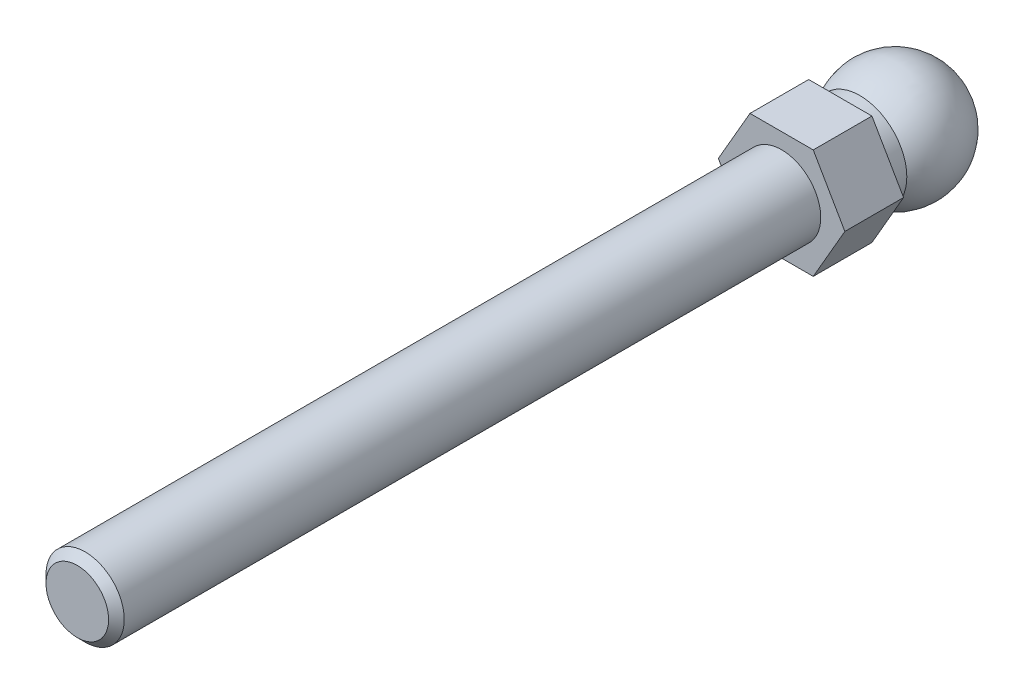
ISO-10303-21;
HEADER;
FILE_DESCRIPTION(('STEP AP214'),'2;1');
FILE_NAME('part.step','',(''),(''),'','','');
FILE_SCHEMA(('AUTOMOTIVE_DESIGN { 1 0 10303 214 1 1 1 1 }'));
ENDSEC;
DATA;
#1=APPLICATION_CONTEXT('core data for automotive mechanical design processes');
#2=APPLICATION_PROTOCOL_DEFINITION('international standard','automotive_design',2000,#1);
#3=PRODUCT_CONTEXT('',#1,'mechanical');
#4=PRODUCT('Part','Part','',(#3));
#5=PRODUCT_RELATED_PRODUCT_CATEGORY('part','',(#4));
#6=PRODUCT_DEFINITION_FORMATION('','',#4);
#7=PRODUCT_DEFINITION_CONTEXT('part definition',#1,'design');
#8=PRODUCT_DEFINITION('design','',#6,#7);
#9=PRODUCT_DEFINITION_SHAPE('','',#8);
#10=(LENGTH_UNIT() NAMED_UNIT(*) SI_UNIT(.MILLI.,.METRE.));
#11=(NAMED_UNIT(*) PLANE_ANGLE_UNIT() SI_UNIT($,.RADIAN.));
#12=(NAMED_UNIT(*) SI_UNIT($,.STERADIAN.) SOLID_ANGLE_UNIT());
#13=UNCERTAINTY_MEASURE_WITH_UNIT(LENGTH_MEASURE(1.E-05),#10,'distance_accuracy_value','');
#14=(GEOMETRIC_REPRESENTATION_CONTEXT(3) GLOBAL_UNCERTAINTY_ASSIGNED_CONTEXT((#13)) GLOBAL_UNIT_ASSIGNED_CONTEXT((#10,
#11,#12)) REPRESENTATION_CONTEXT('',''));
#15=CARTESIAN_POINT('',(0.,0.,0.));
#16=DIRECTION('',(0.,0.,1.));
#17=DIRECTION('',(1.,0.,0.));
#18=AXIS2_PLACEMENT_3D('',#15,#16,#17);
#19=CARTESIAN_POINT('',(0.,0.,0.));
#20=DIRECTION('',(1.,0.,0.));
#21=DIRECTION('',(0.,1.,0.));
#22=AXIS2_PLACEMENT_3D('',#19,#20,#21);
#23=SPHERICAL_SURFACE('',#22,7.5);
#24=CARTESIAN_POINT('',(-7.5,0.,0.));
#25=VERTEX_POINT('',#24);
#26=VERTEX_LOOP('',#25);
#27=FACE_BOUND('',#26,.T.);
#28=CARTESIAN_POINT('',(7.5,0.,0.));
#29=VERTEX_POINT('',#28);
#30=VERTEX_LOOP('',#29);
#31=FACE_BOUND('',#30,.T.);
#32=CARTESIAN_POINT('',(0.,0.,4.5));
#33=DIRECTION('',(0.,0.,1.));
#34=DIRECTION('',(1.,0.,0.));
#35=AXIS2_PLACEMENT_3D('',#32,#33,#34);
#36=CIRCLE('',#35,6.);
#37=CARTESIAN_POINT('',(6.,0.,4.5));
#38=VERTEX_POINT('',#37);
#39=EDGE_CURVE('E20',#38,#38,#36,.T.);
#40=ORIENTED_EDGE('',*,*,#39,.F.);
#41=EDGE_LOOP('',(#40));
#42=FACE_BOUND('',#41,.T.);
#43=ADVANCED_FACE('F16',(#27,#31,#42),#23,.T.);
#44=CARTESIAN_POINT('',(0.,0.,0.));
#45=DIRECTION('',(0.,0.,1.));
#46=DIRECTION('',(1.,0.,0.));
#47=AXIS2_PLACEMENT_3D('',#44,#45,#46);
#48=CYLINDRICAL_SURFACE('',#47,6.);
#49=ORIENTED_EDGE('',*,*,#39,.T.);
#50=EDGE_LOOP('',(#49));
#51=FACE_BOUND('',#50,.T.);
#52=CARTESIAN_POINT('',(0.,0.,7.));
#53=DIRECTION('',(0.,0.,1.));
#54=DIRECTION('',(1.,0.,0.));
#55=AXIS2_PLACEMENT_3D('',#52,#53,#54);
#56=CIRCLE('',#55,6.);
#57=CARTESIAN_POINT('',(6.,0.,7.));
#58=VERTEX_POINT('',#57);
#59=EDGE_CURVE('E79',#58,#58,#56,.F.);
#60=ORIENTED_EDGE('',*,*,#59,.T.);
#61=EDGE_LOOP('',(#60));
#62=FACE_BOUND('',#61,.T.);
#63=ADVANCED_FACE('F74',(#51,#62),#48,.T.);
#64=CARTESIAN_POINT('',(0.,0.,7.));
#65=DIRECTION('',(0.,0.,1.));
#66=DIRECTION('',(1.,0.,0.));
#67=AXIS2_PLACEMENT_3D('',#64,#65,#66);
#68=PLANE('',#67);
#69=ORIENTED_EDGE('',*,*,#59,.F.);
#70=EDGE_LOOP('',(#69));
#71=FACE_BOUND('',#70,.T.);
#72=DIRECTION('',(-0.500000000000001,0.866025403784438,0.));
#73=VECTOR('',#72,1.);
#74=CARTESIAN_POINT('',(4.04145188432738,7.,7.));
#75=LINE('',#74,#73);
#76=CARTESIAN_POINT('',(8.08290376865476,0.,7.));
#77=VERTEX_POINT('',#76);
#78=CARTESIAN_POINT('',(4.04145188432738,7.,7.));
#79=VERTEX_POINT('',#78);
#80=EDGE_CURVE('E81',#77,#79,#75,.T.);
#81=ORIENTED_EDGE('',*,*,#80,.F.);
#82=DIRECTION('',(0.5,0.866025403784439,0.));
#83=VECTOR('',#82,1.);
#84=CARTESIAN_POINT('',(8.08290376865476,0.,7.));
#85=LINE('',#84,#83);
#86=CARTESIAN_POINT('',(4.04145188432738,-7.,7.));
#87=VERTEX_POINT('',#86);
#88=EDGE_CURVE('E114',#87,#77,#85,.T.);
#89=ORIENTED_EDGE('',*,*,#88,.F.);
#90=DIRECTION('',(1.,0.,0.));
#91=VECTOR('',#90,1.);
#92=CARTESIAN_POINT('',(4.04145188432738,-7.,7.));
#93=LINE('',#92,#91);
#94=CARTESIAN_POINT('',(-4.04145188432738,-7.,7.));
#95=VERTEX_POINT('',#94);
#96=EDGE_CURVE('E111',#95,#87,#93,.T.);
#97=ORIENTED_EDGE('',*,*,#96,.F.);
#98=DIRECTION('',(0.5,-0.866025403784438,0.));
#99=VECTOR('',#98,1.);
#100=CARTESIAN_POINT('',(-4.04145188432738,-7.,7.));
#101=LINE('',#100,#99);
#102=CARTESIAN_POINT('',(-8.08290376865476,0.,7.));
#103=VERTEX_POINT('',#102);
#104=EDGE_CURVE('E106',#103,#95,#101,.T.);
#105=ORIENTED_EDGE('',*,*,#104,.F.);
#106=DIRECTION('',(-0.5,-0.866025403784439,0.));
#107=VECTOR('',#106,1.);
#108=CARTESIAN_POINT('',(-8.08290376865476,0.,7.));
#109=LINE('',#108,#107);
#110=CARTESIAN_POINT('',(-4.04145188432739,7.,7.));
#111=VERTEX_POINT('',#110);
#112=EDGE_CURVE('E101',#111,#103,#109,.T.);
#113=ORIENTED_EDGE('',*,*,#112,.F.);
#114=DIRECTION('',(1.,0.,0.));
#115=VECTOR('',#114,1.);
#116=CARTESIAN_POINT('',(-4.04145188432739,7.,7.));
#117=LINE('',#116,#115);
#118=EDGE_CURVE('E96',#79,#111,#117,.F.);
#119=ORIENTED_EDGE('',*,*,#118,.F.);
#120=EDGE_LOOP('',(#81,#89,#97,#105,#113,#119));
#121=FACE_BOUND('',#120,.T.);
#122=ADVANCED_FACE('F235',(#71,#121),#68,.F.);
#123=CARTESIAN_POINT('',(4.04145188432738,7.,7.));
#124=DIRECTION('',(0.866025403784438,0.500000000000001,0.));
#125=DIRECTION('',(-0.500000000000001,0.866025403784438,0.));
#126=AXIS2_PLACEMENT_3D('',#123,#124,#125);
#127=PLANE('',#126);
#128=ORIENTED_EDGE('',*,*,#80,.T.);
#129=DIRECTION('',(0.,0.,1.));
#130=VECTOR('',#129,1.);
#131=CARTESIAN_POINT('',(4.04145188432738,7.,7.));
#132=LINE('',#131,#130);
#133=CARTESIAN_POINT('',(4.04145188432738,7.,14.5));
#134=VERTEX_POINT('',#133);
#135=EDGE_CURVE('E84',#134,#79,#132,.F.);
#136=ORIENTED_EDGE('',*,*,#135,.F.);
#137=DIRECTION('',(-0.500000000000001,0.866025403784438,0.));
#138=VECTOR('',#137,1.);
#139=CARTESIAN_POINT('',(8.08290376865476,0.,14.5));
#140=LINE('',#139,#138);
#141=CARTESIAN_POINT('',(8.08290376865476,0.,14.5));
#142=VERTEX_POINT('',#141);
#143=EDGE_CURVE('E120',#142,#134,#140,.T.);
#144=ORIENTED_EDGE('',*,*,#143,.F.);
#145=DIRECTION('',(0.,0.,1.));
#146=VECTOR('',#145,1.);
#147=CARTESIAN_POINT('',(8.08290376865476,0.,7.));
#148=LINE('',#147,#146);
#149=EDGE_CURVE('E117',#77,#142,#148,.T.);
#150=ORIENTED_EDGE('',*,*,#149,.F.);
#151=EDGE_LOOP('',(#128,#136,#144,#150));
#152=FACE_BOUND('',#151,.T.);
#153=ADVANCED_FACE('F145',(#152),#127,.T.);
#154=CARTESIAN_POINT('',(-4.04145188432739,7.,7.));
#155=DIRECTION('',(0.,1.,0.));
#156=DIRECTION('',(0.,0.,1.));
#157=AXIS2_PLACEMENT_3D('',#154,#155,#156);
#158=PLANE('',#157);
#159=ORIENTED_EDGE('',*,*,#118,.T.);
#160=DIRECTION('',(0.,0.,1.));
#161=VECTOR('',#160,1.);
#162=CARTESIAN_POINT('',(-4.04145188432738,7.,7.));
#163=LINE('',#162,#161);
#164=CARTESIAN_POINT('',(-4.04145188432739,7.,14.5));
#165=VERTEX_POINT('',#164);
#166=EDGE_CURVE('E98',#165,#111,#163,.F.);
#167=ORIENTED_EDGE('',*,*,#166,.F.);
#168=DIRECTION('',(1.,0.,0.));
#169=VECTOR('',#168,1.);
#170=CARTESIAN_POINT('',(0.,7.,14.5));
#171=LINE('',#170,#169);
#172=EDGE_CURVE('E123',#134,#165,#171,.F.);
#173=ORIENTED_EDGE('',*,*,#172,.F.);
#174=ORIENTED_EDGE('',*,*,#135,.T.);
#175=EDGE_LOOP('',(#159,#167,#173,#174));
#176=FACE_BOUND('',#175,.T.);
#177=ADVANCED_FACE('F149',(#176),#158,.T.);
#178=CARTESIAN_POINT('',(-8.08290376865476,0.,7.));
#179=DIRECTION('',(-0.866025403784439,0.5,0.));
#180=DIRECTION('',(-0.5,-0.866025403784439,0.));
#181=AXIS2_PLACEMENT_3D('',#178,#179,#180);
#182=PLANE('',#181);
#183=ORIENTED_EDGE('',*,*,#112,.T.);
#184=DIRECTION('',(0.,0.,1.));
#185=VECTOR('',#184,1.);
#186=CARTESIAN_POINT('',(-8.08290376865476,0.,7.));
#187=LINE('',#186,#185);
#188=CARTESIAN_POINT('',(-8.08290376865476,0.,14.5));
#189=VERTEX_POINT('',#188);
#190=EDGE_CURVE('E103',#189,#103,#187,.F.);
#191=ORIENTED_EDGE('',*,*,#190,.F.);
#192=DIRECTION('',(-0.5,-0.866025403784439,0.));
#193=VECTOR('',#192,1.);
#194=CARTESIAN_POINT('',(-4.04145188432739,7.,14.5));
#195=LINE('',#194,#193);
#196=EDGE_CURVE('E126',#165,#189,#195,.T.);
#197=ORIENTED_EDGE('',*,*,#196,.F.);
#198=ORIENTED_EDGE('',*,*,#166,.T.);
#199=EDGE_LOOP('',(#183,#191,#197,#198));
#200=FACE_BOUND('',#199,.T.);
#201=ADVANCED_FACE('F153',(#200),#182,.T.);
#202=CARTESIAN_POINT('',(-4.04145188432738,-7.,7.));
#203=DIRECTION('',(-0.866025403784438,-0.5,0.));
#204=DIRECTION('',(0.5,-0.866025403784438,0.));
#205=AXIS2_PLACEMENT_3D('',#202,#203,#204);
#206=PLANE('',#205);
#207=ORIENTED_EDGE('',*,*,#104,.T.);
#208=DIRECTION('',(0.,0.,-1.));
#209=VECTOR('',#208,1.);
#210=CARTESIAN_POINT('',(-4.04145188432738,-7.,7.));
#211=LINE('',#210,#209);
#212=CARTESIAN_POINT('',(-4.04145188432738,-7.,14.5));
#213=VERTEX_POINT('',#212);
#214=EDGE_CURVE('E108',#213,#95,#211,.T.);
#215=ORIENTED_EDGE('',*,*,#214,.F.);
#216=DIRECTION('',(0.5,-0.866025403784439,0.));
#217=VECTOR('',#216,1.);
#218=CARTESIAN_POINT('',(-8.08290376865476,0.,14.5));
#219=LINE('',#218,#217);
#220=EDGE_CURVE('E129',#189,#213,#219,.T.);
#221=ORIENTED_EDGE('',*,*,#220,.F.);
#222=ORIENTED_EDGE('',*,*,#190,.T.);
#223=EDGE_LOOP('',(#207,#215,#221,#222));
#224=FACE_BOUND('',#223,.T.);
#225=ADVANCED_FACE('F157',(#224),#206,.T.);
#226=CARTESIAN_POINT('',(4.04145188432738,-7.,7.));
#227=DIRECTION('',(0.,-1.,0.));
#228=DIRECTION('',(0.,0.,-1.));
#229=AXIS2_PLACEMENT_3D('',#226,#227,#228);
#230=PLANE('',#229);
#231=ORIENTED_EDGE('',*,*,#96,.T.);
#232=DIRECTION('',(0.,0.,1.));
#233=VECTOR('',#232,1.);
#234=CARTESIAN_POINT('',(4.04145188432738,-7.,7.));
#235=LINE('',#234,#233);
#236=CARTESIAN_POINT('',(4.04145188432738,-7.,14.5));
#237=VERTEX_POINT('',#236);
#238=EDGE_CURVE('E35',#237,#87,#235,.F.);
#239=ORIENTED_EDGE('',*,*,#238,.F.);
#240=DIRECTION('',(1.,0.,0.));
#241=VECTOR('',#240,1.);
#242=CARTESIAN_POINT('',(0.,-7.,14.5));
#243=LINE('',#242,#241);
#244=EDGE_CURVE('E132',#213,#237,#243,.T.);
#245=ORIENTED_EDGE('',*,*,#244,.F.);
#246=ORIENTED_EDGE('',*,*,#214,.T.);
#247=EDGE_LOOP('',(#231,#239,#245,#246));
#248=FACE_BOUND('',#247,.T.);
#249=ADVANCED_FACE('F159',(#248),#230,.T.);
#250=CARTESIAN_POINT('',(8.08290376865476,0.,7.));
#251=DIRECTION('',(0.866025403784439,-0.5,0.));
#252=DIRECTION('',(0.5,0.866025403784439,0.));
#253=AXIS2_PLACEMENT_3D('',#250,#251,#252);
#254=PLANE('',#253);
#255=ORIENTED_EDGE('',*,*,#88,.T.);
#256=ORIENTED_EDGE('',*,*,#149,.T.);
#257=DIRECTION('',(0.5,0.866025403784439,0.));
#258=VECTOR('',#257,1.);
#259=CARTESIAN_POINT('',(4.04145188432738,-7.,14.5));
#260=LINE('',#259,#258);
#261=EDGE_CURVE('E90',#237,#142,#260,.T.);
#262=ORIENTED_EDGE('',*,*,#261,.F.);
#263=ORIENTED_EDGE('',*,*,#238,.T.);
#264=EDGE_LOOP('',(#255,#256,#262,#263));
#265=FACE_BOUND('',#264,.T.);
#266=ADVANCED_FACE('F141',(#265),#254,.T.);
#267=CARTESIAN_POINT('',(0.,0.,104.5));
#268=DIRECTION('',(0.,0.,-1.));
#269=DIRECTION('',(-1.,0.,0.));
#270=AXIS2_PLACEMENT_3D('',#267,#268,#269);
#271=PLANE('',#270);
#272=CARTESIAN_POINT('',(0.,0.,104.500000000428));
#273=DIRECTION('',(0.,0.,-1.));
#274=DIRECTION('',(0.,1.,0.));
#275=AXIS2_PLACEMENT_3D('',#272,#273,#274);
#276=CIRCLE('',#275,4.00000000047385);
#277=CARTESIAN_POINT('',(0.,4.00000000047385,104.500000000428));
#278=VERTEX_POINT('',#277);
#279=EDGE_CURVE('E87',#278,#278,#276,.T.);
#280=ORIENTED_EDGE('',*,*,#279,.F.);
#281=EDGE_LOOP('',(#280));
#282=FACE_BOUND('',#281,.T.);
#283=ADVANCED_FACE('F167',(#282),#271,.F.);
#284=CARTESIAN_POINT('',(0.,0.,14.5));
#285=DIRECTION('',(0.,0.,1.));
#286=DIRECTION('',(1.,0.,0.));
#287=AXIS2_PLACEMENT_3D('',#284,#285,#286);
#288=PLANE('',#287);
#289=CARTESIAN_POINT('',(0.,0.,14.5));
#290=DIRECTION('',(0.,0.,1.));
#291=DIRECTION('',(0.,-1.,0.));
#292=AXIS2_PLACEMENT_3D('',#289,#290,#291);
#293=CIRCLE('',#292,5.);
#294=CARTESIAN_POINT('',(0.,-5.,14.5));
#295=VERTEX_POINT('',#294);
#296=EDGE_CURVE('E26',#295,#295,#293,.T.);
#297=ORIENTED_EDGE('',*,*,#296,.F.);
#298=EDGE_LOOP('',(#297));
#299=FACE_BOUND('',#298,.T.);
#300=ORIENTED_EDGE('',*,*,#244,.T.);
#301=ORIENTED_EDGE('',*,*,#261,.T.);
#302=ORIENTED_EDGE('',*,*,#143,.T.);
#303=ORIENTED_EDGE('',*,*,#172,.T.);
#304=ORIENTED_EDGE('',*,*,#196,.T.);
#305=ORIENTED_EDGE('',*,*,#220,.T.);
#306=EDGE_LOOP('',(#300,#301,#302,#303,#304,#305));
#307=FACE_BOUND('',#306,.T.);
#308=ADVANCED_FACE('F139',(#299,#307),#288,.T.);
#309=CARTESIAN_POINT('',(0.,0.,103.499999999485));
#310=DIRECTION('',(0.,0.,-1.));
#311=DIRECTION('',(0.,1.,0.));
#312=AXIS2_PLACEMENT_3D('',#309,#310,#311);
#313=CONICAL_SURFACE('',#312,4.99999999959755,0.785398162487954);
#314=CARTESIAN_POINT('',(0.,0.,103.5));
#315=DIRECTION('',(0.,0.,1.));
#316=DIRECTION('',(0.,-1.,0.));
#317=AXIS2_PLACEMENT_3D('',#314,#315,#316);
#318=CIRCLE('',#317,5.);
#319=CARTESIAN_POINT('',(0.,-5.,103.5));
#320=VERTEX_POINT('',#319);
#321=EDGE_CURVE('E11',#320,#320,#318,.F.);
#322=ORIENTED_EDGE('',*,*,#321,.F.);
#323=EDGE_LOOP('',(#322));
#324=FACE_BOUND('',#323,.T.);
#325=ORIENTED_EDGE('',*,*,#279,.T.);
#326=EDGE_LOOP('',(#325));
#327=FACE_BOUND('',#326,.T.);
#328=ADVANCED_FACE('F172',(#324,#327),#313,.T.);
#329=CARTESIAN_POINT('',(0.,0.,14.5));
#330=DIRECTION('',(0.,0.,1.));
#331=DIRECTION('',(0.,-1.,0.));
#332=AXIS2_PLACEMENT_3D('',#329,#330,#331);
#333=CYLINDRICAL_SURFACE('',#332,5.);
#334=ORIENTED_EDGE('',*,*,#321,.T.);
#335=EDGE_LOOP('',(#334));
#336=FACE_BOUND('',#335,.T.);
#337=ORIENTED_EDGE('',*,*,#296,.T.);
#338=EDGE_LOOP('',(#337));
#339=FACE_BOUND('',#338,.T.);
#340=ADVANCED_FACE('F170',(#336,#339),#333,.T.);
#341=CLOSED_SHELL('',(#43,#63,#122,#153,#177,#201,#225,#249,#266,#283,#308,#328,#340));
#342=MANIFOLD_SOLID_BREP('B1',#341);
#343=ADVANCED_BREP_SHAPE_REPRESENTATION('',(#18,#342),#14);
#344=SHAPE_DEFINITION_REPRESENTATION(#9,#343);
ENDSEC;
END-ISO-10303-21;
